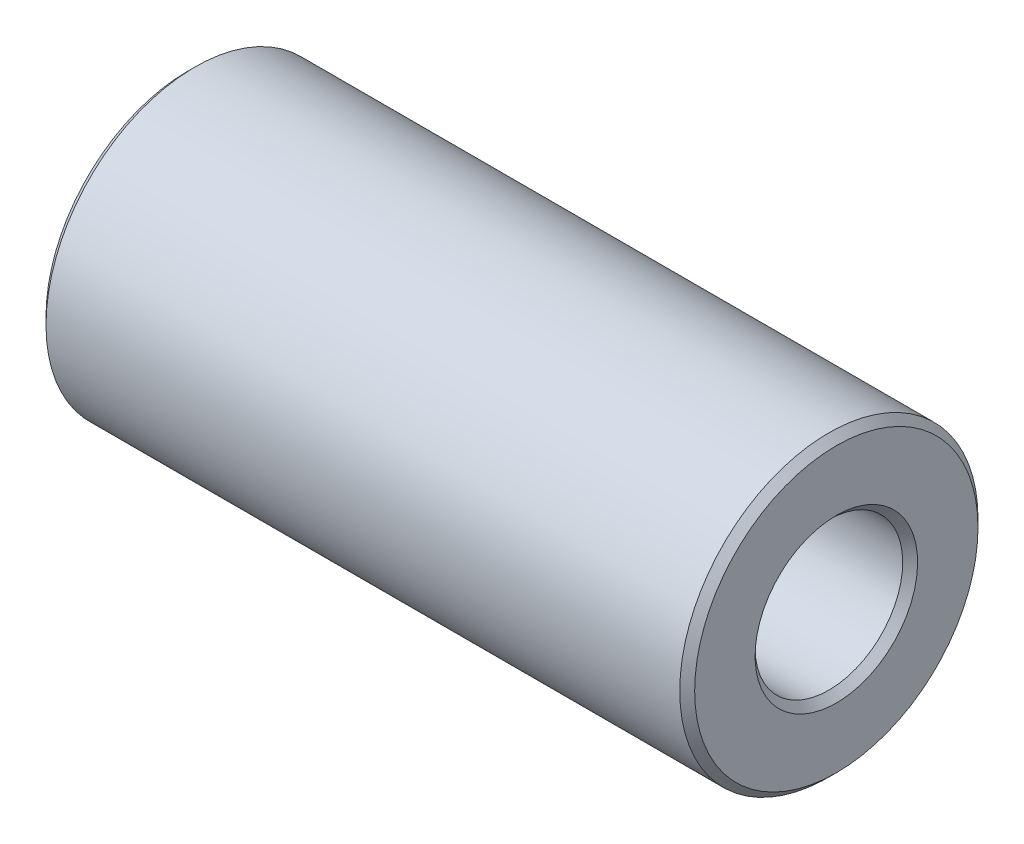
ISO-10303-21;
HEADER;
FILE_DESCRIPTION(('STEP AP214'),'2;1');
FILE_NAME('part.step','',(''),(''),'','','');
FILE_SCHEMA(('AUTOMOTIVE_DESIGN { 1 0 10303 214 1 1 1 1 }'));
ENDSEC;
DATA;
#1=APPLICATION_CONTEXT('core data for automotive mechanical design processes');
#2=APPLICATION_PROTOCOL_DEFINITION('international standard','automotive_design',2000,#1);
#3=PRODUCT_CONTEXT('',#1,'mechanical');
#4=PRODUCT('Part','Part','',(#3));
#5=PRODUCT_RELATED_PRODUCT_CATEGORY('part','',(#4));
#6=PRODUCT_DEFINITION_FORMATION('','',#4);
#7=PRODUCT_DEFINITION_CONTEXT('part definition',#1,'design');
#8=PRODUCT_DEFINITION('design','',#6,#7);
#9=PRODUCT_DEFINITION_SHAPE('','',#8);
#10=(LENGTH_UNIT() NAMED_UNIT(*) SI_UNIT(.MILLI.,.METRE.));
#11=(NAMED_UNIT(*) PLANE_ANGLE_UNIT() SI_UNIT($,.RADIAN.));
#12=(NAMED_UNIT(*) SI_UNIT($,.STERADIAN.) SOLID_ANGLE_UNIT());
#13=UNCERTAINTY_MEASURE_WITH_UNIT(LENGTH_MEASURE(1.E-05),#10,'distance_accuracy_value','');
#14=(GEOMETRIC_REPRESENTATION_CONTEXT(3) GLOBAL_UNCERTAINTY_ASSIGNED_CONTEXT((#13)) GLOBAL_UNIT_ASSIGNED_CONTEXT((#10,
#11,#12)) REPRESENTATION_CONTEXT('',''));
#15=CARTESIAN_POINT('',(0.,0.,0.));
#16=DIRECTION('',(0.,0.,1.));
#17=DIRECTION('',(1.,0.,0.));
#18=AXIS2_PLACEMENT_3D('',#15,#16,#17);
#19=CARTESIAN_POINT('',(57.86997986,0.,0.));
#20=DIRECTION('',(1.,0.,0.));
#21=DIRECTION('',(0.,0.,-1.));
#22=AXIS2_PLACEMENT_3D('',#19,#20,#21);
#23=CYLINDRICAL_SURFACE('',#22,4.94999999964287);
#24=CARTESIAN_POINT('',(56.3699798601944,0.,0.));
#25=DIRECTION('',(-1.,0.,0.));
#26=DIRECTION('',(0.,0.,1.));
#27=AXIS2_PLACEMENT_3D('',#24,#25,#26);
#28=CIRCLE('',#27,4.94999999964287);
#29=CARTESIAN_POINT('',(56.3699798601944,0.,4.94999999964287));
#30=VERTEX_POINT('',#29);
#31=EDGE_CURVE('E41',#30,#30,#28,.T.);
#32=ORIENTED_EDGE('',*,*,#31,.T.);
#33=EDGE_LOOP('',(#32));
#34=FACE_BOUND('',#33,.T.);
#35=CARTESIAN_POINT('',(98.8699798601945,0.,0.));
#36=DIRECTION('',(1.,0.,0.));
#37=DIRECTION('',(0.,-0.877582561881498,-0.479425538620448));
#38=AXIS2_PLACEMENT_3D('',#35,#36,#37);
#39=CIRCLE('',#38,4.94999999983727);
#40=CARTESIAN_POINT('',(98.8699798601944,-4.34403368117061,-2.3731564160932));
#41=VERTEX_POINT('',#40);
#42=EDGE_CURVE('E59',#41,#41,#39,.T.);
#43=ORIENTED_EDGE('',*,*,#42,.T.);
#44=EDGE_LOOP('',(#43));
#45=FACE_BOUND('',#44,.T.);
#46=ADVANCED_FACE('F30',(#34,#45),#23,.F.);
#47=CARTESIAN_POINT('',(98.8699798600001,0.,0.));
#48=DIRECTION('',(1.,0.,0.));
#49=DIRECTION('',(0.,1.,0.));
#50=AXIS2_PLACEMENT_3D('',#47,#48,#49);
#51=CONICAL_SURFACE('',#50,4.94999999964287,0.785398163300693);
#52=CARTESIAN_POINT('',(99.3699798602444,0.,0.));
#53=DIRECTION('',(1.,0.,0.));
#54=DIRECTION('',(0.,1.,0.));
#55=AXIS2_PLACEMENT_3D('',#52,#53,#54);
#56=CIRCLE('',#55,5.44999999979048);
#57=CARTESIAN_POINT('',(99.3699798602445,5.44999999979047,0.));
#58=VERTEX_POINT('',#57);
#59=EDGE_CURVE('E56',#58,#58,#56,.F.);
#60=ORIENTED_EDGE('',*,*,#59,.F.);
#61=EDGE_LOOP('',(#60));
#62=FACE_BOUND('',#61,.T.);
#63=ORIENTED_EDGE('',*,*,#42,.F.);
#64=EDGE_LOOP('',(#63));
#65=FACE_BOUND('',#64,.T.);
#66=ADVANCED_FACE('F64',(#62,#65),#51,.F.);
#67=CARTESIAN_POINT('',(99.36997986,0.,0.));
#68=DIRECTION('',(1.,0.,0.));
#69=DIRECTION('',(0.,0.,-1.));
#70=AXIS2_PLACEMENT_3D('',#67,#68,#69);
#71=PLANE('',#70);
#72=CARTESIAN_POINT('',(99.36997986,0.,0.));
#73=DIRECTION('',(1.,0.,0.));
#74=DIRECTION('',(0.,0.,-1.));
#75=AXIS2_PLACEMENT_3D('',#72,#73,#74);
#76=CIRCLE('',#75,9.5);
#77=CARTESIAN_POINT('',(99.36997986,0.,-9.5));
#78=VERTEX_POINT('',#77);
#79=EDGE_CURVE('E45',#78,#78,#76,.T.);
#80=ORIENTED_EDGE('',*,*,#79,.T.);
#81=EDGE_LOOP('',(#80));
#82=FACE_BOUND('',#81,.T.);
#83=ORIENTED_EDGE('',*,*,#59,.T.);
#84=EDGE_LOOP('',(#83));
#85=FACE_BOUND('',#84,.T.);
#86=ADVANCED_FACE('F66',(#82,#85),#71,.T.);
#87=CARTESIAN_POINT('',(122.654251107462,0.,0.));
#88=DIRECTION('',(-1.,0.,0.));
#89=DIRECTION('',(0.,0.,1.));
#90=AXIS2_PLACEMENT_3D('',#87,#88,#89);
#91=CYLINDRICAL_SURFACE('',#90,10.);
#92=CARTESIAN_POINT('',(98.86997986,0.,0.));
#93=DIRECTION('',(1.,0.,0.));
#94=DIRECTION('',(0.,0.,-1.));
#95=AXIS2_PLACEMENT_3D('',#92,#93,#94);
#96=CIRCLE('',#95,10.);
#97=CARTESIAN_POINT('',(98.86997986,0.,-10.));
#98=VERTEX_POINT('',#97);
#99=EDGE_CURVE('E50',#98,#98,#96,.F.);
#100=ORIENTED_EDGE('',*,*,#99,.T.);
#101=EDGE_LOOP('',(#100));
#102=FACE_BOUND('',#101,.T.);
#103=CARTESIAN_POINT('',(56.36997986,0.,0.));
#104=DIRECTION('',(-1.,0.,0.));
#105=DIRECTION('',(0.,0.,1.));
#106=AXIS2_PLACEMENT_3D('',#103,#104,#105);
#107=CIRCLE('',#106,10.);
#108=CARTESIAN_POINT('',(56.36997986,0.,10.));
#109=VERTEX_POINT('',#108);
#110=EDGE_CURVE('E53',#109,#109,#107,.F.);
#111=ORIENTED_EDGE('',*,*,#110,.T.);
#112=EDGE_LOOP('',(#111));
#113=FACE_BOUND('',#112,.T.);
#114=ADVANCED_FACE('F73',(#102,#113),#91,.T.);
#115=CARTESIAN_POINT('',(55.86997986,0.,0.));
#116=DIRECTION('',(-1.,0.,0.));
#117=DIRECTION('',(0.,0.,1.));
#118=AXIS2_PLACEMENT_3D('',#115,#116,#117);
#119=PLANE('',#118);
#120=CARTESIAN_POINT('',(55.86997986,0.,0.));
#121=DIRECTION('',(-1.,0.,0.));
#122=DIRECTION('',(0.,0.,1.));
#123=AXIS2_PLACEMENT_3D('',#120,#121,#122);
#124=CIRCLE('',#123,5.44999999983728);
#125=CARTESIAN_POINT('',(55.86997986,0.,5.44999999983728));
#126=VERTEX_POINT('',#125);
#127=EDGE_CURVE('E10',#126,#126,#124,.F.);
#128=ORIENTED_EDGE('',*,*,#127,.T.);
#129=EDGE_LOOP('',(#128));
#130=FACE_BOUND('',#129,.T.);
#131=CARTESIAN_POINT('',(55.86997986,0.,0.));
#132=DIRECTION('',(-1.,0.,0.));
#133=DIRECTION('',(0.,0.,1.));
#134=AXIS2_PLACEMENT_3D('',#131,#132,#133);
#135=CIRCLE('',#134,9.5);
#136=CARTESIAN_POINT('',(55.86997986,0.,9.5));
#137=VERTEX_POINT('',#136);
#138=EDGE_CURVE('E37',#137,#137,#135,.T.);
#139=ORIENTED_EDGE('',*,*,#138,.T.);
#140=EDGE_LOOP('',(#139));
#141=FACE_BOUND('',#140,.T.);
#142=ADVANCED_FACE('F84',(#130,#141),#119,.T.);
#143=CARTESIAN_POINT('',(98.86997986,0.,0.));
#144=DIRECTION('',(-1.,0.,0.));
#145=DIRECTION('',(0.,0.,1.));
#146=AXIS2_PLACEMENT_3D('',#143,#144,#145);
#147=CONICAL_SURFACE('',#146,10.,0.785398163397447);
#148=ORIENTED_EDGE('',*,*,#79,.F.);
#149=EDGE_LOOP('',(#148));
#150=FACE_BOUND('',#149,.T.);
#151=ORIENTED_EDGE('',*,*,#99,.F.);
#152=EDGE_LOOP('',(#151));
#153=FACE_BOUND('',#152,.T.);
#154=ADVANCED_FACE('F81',(#150,#153),#147,.T.);
#155=CARTESIAN_POINT('',(56.3699798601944,0.,0.));
#156=DIRECTION('',(-1.,0.,0.));
#157=DIRECTION('',(0.,0.,1.));
#158=AXIS2_PLACEMENT_3D('',#155,#156,#157);
#159=CONICAL_SURFACE('',#158,4.94999999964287,0.785398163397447);
#160=ORIENTED_EDGE('',*,*,#127,.F.);
#161=EDGE_LOOP('',(#160));
#162=FACE_BOUND('',#161,.T.);
#163=ORIENTED_EDGE('',*,*,#31,.F.);
#164=EDGE_LOOP('',(#163));
#165=FACE_BOUND('',#164,.T.);
#166=ADVANCED_FACE('F83',(#162,#165),#159,.F.);
#167=CARTESIAN_POINT('',(55.86997986,0.,0.));
#168=DIRECTION('',(1.,0.,0.));
#169=DIRECTION('',(0.,0.,-1.));
#170=AXIS2_PLACEMENT_3D('',#167,#168,#169);
#171=CONICAL_SURFACE('',#170,9.5,0.785398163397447);
#172=ORIENTED_EDGE('',*,*,#110,.F.);
#173=EDGE_LOOP('',(#172));
#174=FACE_BOUND('',#173,.T.);
#175=ORIENTED_EDGE('',*,*,#138,.F.);
#176=EDGE_LOOP('',(#175));
#177=FACE_BOUND('',#176,.T.);
#178=ADVANCED_FACE('F32',(#174,#177),#171,.T.);
#179=CLOSED_SHELL('',(#46,#66,#86,#114,#142,#154,#166,#178));
#180=MANIFOLD_SOLID_BREP('B2',#179);
#181=ADVANCED_BREP_SHAPE_REPRESENTATION('',(#18,#180),#14);
#182=SHAPE_DEFINITION_REPRESENTATION(#9,#181);
ENDSEC;
END-ISO-10303-21;
